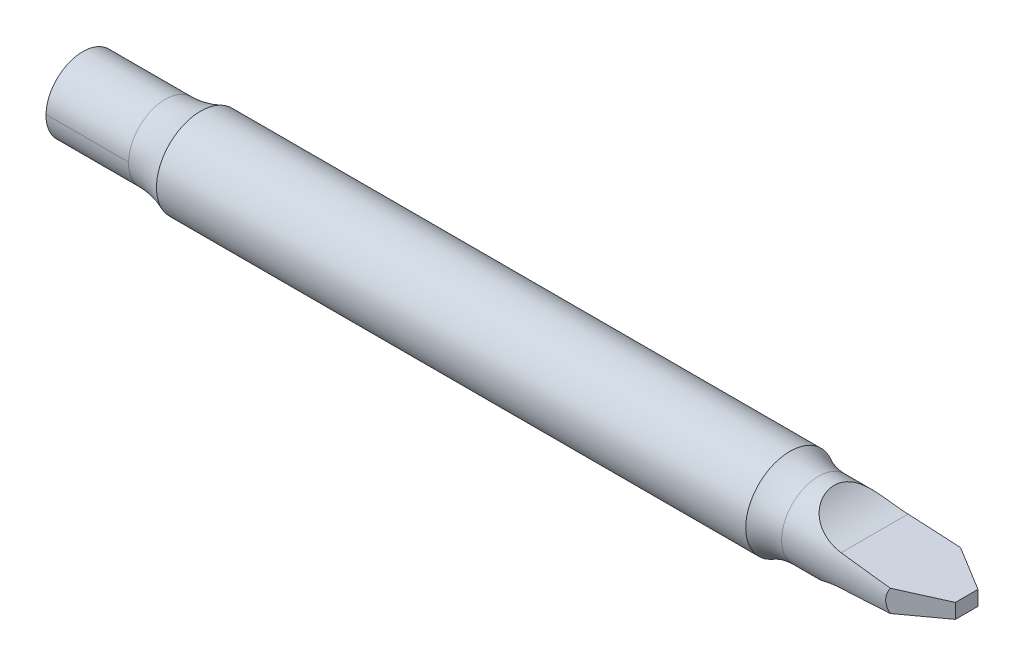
ISO-10303-21;
HEADER;
FILE_DESCRIPTION(('STEP AP214'),'2;1');
FILE_NAME('part.step','',(''),(''),'','','');
FILE_SCHEMA(('AUTOMOTIVE_DESIGN { 1 0 10303 214 1 1 1 1 }'));
ENDSEC;
DATA;
#1=APPLICATION_CONTEXT('core data for automotive mechanical design processes');
#2=APPLICATION_PROTOCOL_DEFINITION('international standard','automotive_design',2000,#1);
#3=PRODUCT_CONTEXT('',#1,'mechanical');
#4=PRODUCT('Part','Part','',(#3));
#5=PRODUCT_RELATED_PRODUCT_CATEGORY('part','',(#4));
#6=PRODUCT_DEFINITION_FORMATION('','',#4);
#7=PRODUCT_DEFINITION_CONTEXT('part definition',#1,'design');
#8=PRODUCT_DEFINITION('design','',#6,#7);
#9=PRODUCT_DEFINITION_SHAPE('','',#8);
#10=(LENGTH_UNIT() NAMED_UNIT(*) SI_UNIT(.MILLI.,.METRE.));
#11=(NAMED_UNIT(*) PLANE_ANGLE_UNIT() SI_UNIT($,.RADIAN.));
#12=(NAMED_UNIT(*) SI_UNIT($,.STERADIAN.) SOLID_ANGLE_UNIT());
#13=UNCERTAINTY_MEASURE_WITH_UNIT(LENGTH_MEASURE(1.E-05),#10,'distance_accuracy_value','');
#14=(GEOMETRIC_REPRESENTATION_CONTEXT(3) GLOBAL_UNCERTAINTY_ASSIGNED_CONTEXT((#13)) GLOBAL_UNIT_ASSIGNED_CONTEXT((#10,
#11,#12)) REPRESENTATION_CONTEXT('',''));
#15=CARTESIAN_POINT('',(0.,0.,0.));
#16=DIRECTION('',(0.,0.,1.));
#17=DIRECTION('',(1.,0.,0.));
#18=AXIS2_PLACEMENT_3D('',#15,#16,#17);
#19=CARTESIAN_POINT('',(50.8,0.,0.));
#20=DIRECTION('',(-1.,0.,0.));
#21=DIRECTION('',(0.,0.,1.));
#22=AXIS2_PLACEMENT_3D('',#19,#20,#21);
#23=CYLINDRICAL_SURFACE('',#22,15.875);
#24=CARTESIAN_POINT('',(35.5732349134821,0.,0.));
#25=DIRECTION('',(1.,0.,0.));
#26=DIRECTION('',(0.,0.,-1.));
#27=AXIS2_PLACEMENT_3D('',#24,#25,#26);
#28=CIRCLE('',#27,15.875);
#29=CARTESIAN_POINT('',(35.5732349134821,-0.333708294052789,-15.8714921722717));
#30=VERTEX_POINT('',#29);
#31=CARTESIAN_POINT('',(35.5732349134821,0.333708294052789,15.8714921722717));
#32=VERTEX_POINT('',#31);
#33=EDGE_CURVE('E307',#30,#32,#28,.F.);
#34=ORIENTED_EDGE('',*,*,#33,.T.);
#35=DIRECTION('',(-1.,0.,0.));
#36=VECTOR('',#35,1.);
#37=CARTESIAN_POINT('',(50.8,0.333708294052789,15.8714921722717));
#38=LINE('',#37,#36);
#39=CARTESIAN_POINT('',(0.,0.333708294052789,15.8714921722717));
#40=VERTEX_POINT('',#39);
#41=EDGE_CURVE('E11',#32,#40,#38,.T.);
#42=ORIENTED_EDGE('',*,*,#41,.T.);
#43=CARTESIAN_POINT('',(0.,0.,0.));
#44=DIRECTION('',(1.,0.,0.));
#45=DIRECTION('',(0.,0.,-1.));
#46=AXIS2_PLACEMENT_3D('',#43,#44,#45);
#47=CIRCLE('',#46,15.875);
#48=CARTESIAN_POINT('',(0.,-0.333708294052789,-15.8714921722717));
#49=VERTEX_POINT('',#48);
#50=EDGE_CURVE('E297',#40,#49,#47,.T.);
#51=ORIENTED_EDGE('',*,*,#50,.T.);
#52=DIRECTION('',(1.,0.,0.));
#53=VECTOR('',#52,1.);
#54=CARTESIAN_POINT('',(50.8,-0.333708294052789,-15.8714921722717));
#55=LINE('',#54,#53);
#56=EDGE_CURVE('E49',#49,#30,#55,.T.);
#57=ORIENTED_EDGE('',*,*,#56,.T.);
#58=EDGE_LOOP('',(#34,#42,#51,#57));
#59=FACE_BOUND('',#58,.T.);
#60=ADVANCED_FACE('F40',(#59),#23,.T.);
#61=CARTESIAN_POINT('',(381.,0.,0.));
#62=DIRECTION('',(-1.,0.,0.));
#63=DIRECTION('',(0.,0.,1.));
#64=AXIS2_PLACEMENT_3D('',#61,#62,#63);
#65=CYLINDRICAL_SURFACE('',#64,15.875);
#66=CARTESIAN_POINT('',(317.096722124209,0.,0.));
#67=DIRECTION('',(-1.,0.,0.));
#68=DIRECTION('',(0.,0.,1.));
#69=AXIS2_PLACEMENT_3D('',#66,#67,#68);
#70=CIRCLE('',#69,15.875);
#71=CARTESIAN_POINT('',(317.096722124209,0.,15.875));
#72=VERTEX_POINT('',#71);
#73=EDGE_CURVE('E303',#72,#72,#70,.F.);
#74=ORIENTED_EDGE('',*,*,#73,.T.);
#75=EDGE_LOOP('',(#74));
#76=FACE_BOUND('',#75,.T.);
#77=CARTESIAN_POINT('',(417.29041606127,0.,0.));
#78=DIRECTION('',(0.0871557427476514,-0.996194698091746,0.));
#79=DIRECTION('',(-0.996194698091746,-0.0871557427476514,0.));
#80=AXIS2_PLACEMENT_3D('',#77,#78,#79);
#81=ELLIPSE('',#80,182.145197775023,15.875);
#82=CARTESIAN_POINT('',(363.200103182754,-4.73228918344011,15.1532525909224));
#83=VERTEX_POINT('',#82);
#84=CARTESIAN_POINT('',(341.301045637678,-6.64820846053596,14.415857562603));
#85=VERTEX_POINT('',#84);
#86=EDGE_CURVE('E285',#83,#85,#81,.T.);
#87=ORIENTED_EDGE('',*,*,#86,.F.);
#88=CARTESIAN_POINT('',(389.446306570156,0.,0.));
#89=DIRECTION('',(0.500000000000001,0.,0.866025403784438));
#90=DIRECTION('',(-0.866025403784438,0.,0.500000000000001));
#91=AXIS2_PLACEMENT_3D('',#88,#89,#90);
#92=ELLIPSE('',#91,31.75,15.875);
#93=CARTESIAN_POINT('',(363.200103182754,4.7322891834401,15.1532525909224));
#94=VERTEX_POINT('',#93);
#95=EDGE_CURVE('E108',#94,#83,#92,.T.);
#96=ORIENTED_EDGE('',*,*,#95,.F.);
#97=CARTESIAN_POINT('',(417.29041606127,0.,0.));
#98=DIRECTION('',(-0.0871557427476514,-0.996194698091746,0.));
#99=DIRECTION('',(-0.996194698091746,0.0871557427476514,0.));
#100=AXIS2_PLACEMENT_3D('',#97,#98,#99);
#101=ELLIPSE('',#100,182.145197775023,15.875);
#102=CARTESIAN_POINT('',(341.301045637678,6.64820846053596,14.415857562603));
#103=VERTEX_POINT('',#102);
#104=EDGE_CURVE('E291',#94,#103,#101,.T.);
#105=ORIENTED_EDGE('',*,*,#104,.T.);
#106=CARTESIAN_POINT('',(341.301045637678,6.64820846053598,-14.415857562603));
#107=CARTESIAN_POINT('',(340.96585426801,6.67752555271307,-14.4023125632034));
#108=CARTESIAN_POINT('',(340.631365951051,6.71350888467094,-14.3856332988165));
#109=CARTESIAN_POINT('',(339.964447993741,6.79866342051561,-14.3455988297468));
#110=CARTESIAN_POINT('',(339.632018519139,6.84783567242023,-14.3222430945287));
#111=CARTESIAN_POINT('',(338.96942041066,6.95930350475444,-14.2684093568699));
#112=CARTESIAN_POINT('',(338.639255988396,7.0216189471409,-14.2379205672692));
#113=CARTESIAN_POINT('',(337.982423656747,7.15910804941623,-14.1692877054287));
#114=CARTESIAN_POINT('',(337.655755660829,7.23428139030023,-14.1311438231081));
#115=CARTESIAN_POINT('',(337.004322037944,7.39779160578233,-14.0462396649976));
#116=CARTESIAN_POINT('',(336.679586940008,7.48621917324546,-13.9994194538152));
#117=CARTESIAN_POINT('',(336.035226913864,7.67546032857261,-13.8965654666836));
#118=CARTESIAN_POINT('',(335.715601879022,7.77627365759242,-13.8405318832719));
#119=CARTESIAN_POINT('',(335.082536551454,7.98974263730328,-13.7184091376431));
#120=CARTESIAN_POINT('',(334.76909193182,8.10238962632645,-13.6523273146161));
#121=CARTESIAN_POINT('',(334.149107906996,8.33897467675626,-13.5091166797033));
#122=CARTESIAN_POINT('',(333.842567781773,8.46291155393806,-13.431989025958));
#123=CARTESIAN_POINT('',(333.122933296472,8.77021446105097,-13.2341931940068));
#124=CARTESIAN_POINT('',(332.713333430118,8.958343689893,-13.1080837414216));
#125=CARTESIAN_POINT('',(331.911765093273,9.35224061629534,-12.8300156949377));
#126=CARTESIAN_POINT('',(331.519795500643,9.55800718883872,-12.6780587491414));
#127=CARTESIAN_POINT('',(330.757847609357,9.98317432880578,-12.3460241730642));
#128=CARTESIAN_POINT('',(330.38779048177,10.202519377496,-12.166057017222));
#129=CARTESIAN_POINT('',(329.671126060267,10.6515223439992,-11.7749422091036));
#130=CARTESIAN_POINT('',(329.324514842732,10.8811785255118,-11.5637997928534));
#131=CARTESIAN_POINT('',(328.713490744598,11.3070416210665,-11.146293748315));
#132=CARTESIAN_POINT('',(328.44501913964,11.5024274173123,-10.9450240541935));
#133=CARTESIAN_POINT('',(327.928105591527,11.8936395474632,-10.5185858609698));
#134=CARTESIAN_POINT('',(327.679661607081,12.0894658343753,-10.2934198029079));
#135=CARTESIAN_POINT('',(327.204203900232,12.4780146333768,-9.81880044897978));
#136=CARTESIAN_POINT('',(326.977197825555,12.6707360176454,-9.56933854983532));
#137=CARTESIAN_POINT('',(326.54595234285,13.0491603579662,-9.04649961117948));
#138=CARTESIAN_POINT('',(326.341713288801,13.2348632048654,-8.77312219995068));
#139=CARTESIAN_POINT('',(325.956019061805,13.5961907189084,-8.20206697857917));
#140=CARTESIAN_POINT('',(325.774676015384,13.7717636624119,-7.90428052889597));
#141=CARTESIAN_POINT('',(325.436480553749,14.1080334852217,-7.28714504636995));
#142=CARTESIAN_POINT('',(325.279628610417,14.2687300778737,-6.967795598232));
#143=CARTESIAN_POINT('',(324.990662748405,14.5716764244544,-6.3097588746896));
#144=CARTESIAN_POINT('',(324.858547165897,14.7139274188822,-5.97107290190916));
#145=CARTESIAN_POINT('',(324.618996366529,14.9768603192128,-5.27702131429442));
#146=CARTESIAN_POINT('',(324.511559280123,15.0975438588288,-4.9216569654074));
#147=CARTESIAN_POINT('',(324.329614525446,15.305055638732,-4.22960368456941));
#148=CARTESIAN_POINT('',(324.253024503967,15.3939434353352,-3.89407604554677));
#149=CARTESIAN_POINT('',(324.119858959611,15.5501284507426,-3.21415264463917));
#150=CARTESIAN_POINT('',(324.063282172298,15.6174270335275,-2.86975744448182));
#151=CARTESIAN_POINT('',(323.96990199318,15.729278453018,-2.17470041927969));
#152=CARTESIAN_POINT('',(323.933096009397,15.7738342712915,-1.82403942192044));
#153=CARTESIAN_POINT('',(323.879056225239,15.8394675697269,-1.1190281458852));
#154=CARTESIAN_POINT('',(323.861822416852,15.8605450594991,-0.764677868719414));
#155=CARTESIAN_POINT('',(323.847019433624,15.8786426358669,-0.0639015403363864));
#156=CARTESIAN_POINT('',(323.848965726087,15.8762554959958,0.282499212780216));
#157=CARTESIAN_POINT('',(323.871374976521,15.8488798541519,0.973799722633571));
#158=CARTESIAN_POINT('',(323.891837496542,15.8238918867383,1.31869951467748));
#159=CARTESIAN_POINT('',(323.951383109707,15.7517129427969,2.00450370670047));
#160=CARTESIAN_POINT('',(323.990464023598,15.7045245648,2.34540856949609));
#161=CARTESIAN_POINT('',(324.087431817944,15.5886994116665,3.02084088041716));
#162=CARTESIAN_POINT('',(324.145318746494,15.5200625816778,3.35536831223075));
#163=CARTESIAN_POINT('',(324.280048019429,15.3625522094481,4.01528999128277));
#164=CARTESIAN_POINT('',(324.356867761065,15.2737028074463,4.340694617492));
#165=CARTESIAN_POINT('',(324.529721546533,15.0771990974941,4.98053135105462));
#166=CARTESIAN_POINT('',(324.625755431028,14.9695449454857,5.29496354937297));
#167=CARTESIAN_POINT('',(324.837189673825,14.7372731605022,5.91072509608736));
#168=CARTESIAN_POINT('',(324.952587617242,14.6126576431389,6.21205607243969));
#169=CARTESIAN_POINT('',(325.202806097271,14.3486026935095,6.79978083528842));
#170=CARTESIAN_POINT('',(325.337626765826,14.2091631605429,7.08617452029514));
#171=CARTESIAN_POINT('',(325.628239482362,13.9162013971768,7.64564076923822));
#172=CARTESIAN_POINT('',(325.784255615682,13.7625352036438,7.91852143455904));
#173=CARTESIAN_POINT('',(326.115699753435,13.4452340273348,8.44606818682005));
#174=CARTESIAN_POINT('',(326.291127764,13.2815990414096,8.70073426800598));
#175=CARTESIAN_POINT('',(326.660831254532,12.9471912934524,9.19096932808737));
#176=CARTESIAN_POINT('',(326.855107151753,12.7764183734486,9.42653788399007));
#177=CARTESIAN_POINT('',(327.261711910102,12.4305827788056,9.87811422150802));
#178=CARTESIAN_POINT('',(327.474041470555,12.2555199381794,10.0941212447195));
#179=CARTESIAN_POINT('',(327.929842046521,11.8926610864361,10.5196642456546));
#180=CARTESIAN_POINT('',(328.174435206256,11.7047643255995,10.7279115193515));
#181=CARTESIAN_POINT('',(328.681549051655,11.3303517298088,11.1226245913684));
#182=CARTESIAN_POINT('',(328.944070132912,11.1438359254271,11.3090899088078));
#183=CARTESIAN_POINT('',(329.485660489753,10.7749019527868,11.6611392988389));
#184=CARTESIAN_POINT('',(329.764736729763,10.592485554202,11.8267144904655));
#185=CARTESIAN_POINT('',(330.337811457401,10.2342512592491,12.1380415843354));
#186=CARTESIAN_POINT('',(330.631812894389,10.0584346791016,12.2837895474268));
#187=CARTESIAN_POINT('',(331.362432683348,9.64181325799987,12.6154404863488));
#188=CARTESIAN_POINT('',(331.806054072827,9.40554172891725,12.7916911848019));
#189=CARTESIAN_POINT('',(332.716331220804,8.95566041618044,13.110601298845));
#190=CARTESIAN_POINT('',(333.182995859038,8.7420594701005,13.2532476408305));
#191=CARTESIAN_POINT('',(334.136262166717,8.34072878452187,13.5094287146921));
#192=CARTESIAN_POINT('',(334.622904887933,8.15305617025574,13.6228996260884));
#193=CARTESIAN_POINT('',(335.611423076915,7.80676474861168,13.8242608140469));
#194=CARTESIAN_POINT('',(336.113295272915,7.64813975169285,13.9121565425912));
#195=CARTESIAN_POINT('',(337.002066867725,7.39750988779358,14.046610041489));
#196=CARTESIAN_POINT('',(337.38636393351,7.29876204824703,14.0980092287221));
#197=CARTESIAN_POINT('',(338.160402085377,7.11915123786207,14.1895547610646));
#198=CARTESIAN_POINT('',(338.550142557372,7.03828626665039,14.2297023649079));
#199=CARTESIAN_POINT('',(339.331725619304,6.89524104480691,14.2995688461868));
#200=CARTESIAN_POINT('',(339.723544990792,6.83296084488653,14.3293436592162));
#201=CARTESIAN_POINT('',(340.510265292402,6.72675391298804,14.3794813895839));
#202=CARTESIAN_POINT('',(340.90516623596,6.6828272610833,14.3998442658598));
#203=CARTESIAN_POINT('',(341.301045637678,6.64820846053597,14.415857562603));
#204=B_SPLINE_CURVE_WITH_KNOTS('',3,(#106,#107,#108,#109,#110,#111,#112,#113,#114,#115,#116,
#117,#118,#119,#120,#121,#122,#123,#124,#125,#126,#127,#128,#129,#130,#131,#132,#133,#134,#135,
#136,#137,#138,#139,#140,#141,#142,#143,#144,#145,#146,#147,#148,#149,#150,#151,#152,#153,#154,
#155,#156,#157,#158,#159,#160,#161,#162,#163,#164,#165,#166,#167,#168,#169,#170,#171,#172,#173,
#174,#175,#176,#177,#178,#179,#180,#181,#182,#183,#184,#185,#186,#187,#188,#189,#190,#191,#192,
#193,#194,#195,#196,#197,#198,#199,#200,#201,#202,#203),.UNSPECIFIED.,.F.,.F.,(4,2,2,2,2,2,2,2,
2,2,2,2,2,2,2,2,2,2,2,2,2,2,2,2,2,2,2,2,2,2,2,2,2,2,2,2,2,2,2,2,2,2,2,2,2,2,2,2,4),(0.,
1.01015937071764,2.02039903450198,3.03217645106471,4.04392876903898,5.06294999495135,
6.08194992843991,7.10020913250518,8.11836165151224,9.52115054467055,10.9238500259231,
12.321151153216,13.7182178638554,14.8819013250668,16.0454660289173,17.2094442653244,
18.3734405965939,19.5429327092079,20.7124473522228,21.8818833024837,23.0512306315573,
24.1162817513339,25.181265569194,26.2461097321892,27.3109534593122,28.3489671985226,
29.3869563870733,30.4248241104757,31.4626944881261,32.4993317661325,33.5359604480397,
34.5724599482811,35.608966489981,36.6574360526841,37.7059059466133,38.7543990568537,
39.8029327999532,40.9182584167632,42.0336086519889,43.1494314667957,44.2654756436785,
45.8610273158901,47.4571987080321,49.0568325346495,50.6561251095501,51.855847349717,
53.0554353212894,54.2484505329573,55.4414709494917),.UNSPECIFIED.);
#205=CARTESIAN_POINT('',(341.301045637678,6.64820846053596,-14.415857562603));
#206=VERTEX_POINT('',#205);
#207=EDGE_CURVE('E127',#206,#103,#204,.T.);
#208=ORIENTED_EDGE('',*,*,#207,.F.);
#209=CARTESIAN_POINT('',(363.200103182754,4.7322891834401,-15.1532525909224));
#210=VERTEX_POINT('',#209);
#211=EDGE_CURVE('E293',#206,#210,#101,.T.);
#212=ORIENTED_EDGE('',*,*,#211,.T.);
#213=CARTESIAN_POINT('',(389.446306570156,0.,0.));
#214=DIRECTION('',(-0.500000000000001,0.,0.866025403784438));
#215=DIRECTION('',(-0.866025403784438,0.,-0.500000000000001));
#216=AXIS2_PLACEMENT_3D('',#213,#214,#215);
#217=ELLIPSE('',#216,31.75,15.875);
#218=CARTESIAN_POINT('',(363.200103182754,-4.73228918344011,-15.1532525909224));
#219=VERTEX_POINT('',#218);
#220=EDGE_CURVE('E274',#210,#219,#217,.T.);
#221=ORIENTED_EDGE('',*,*,#220,.T.);
#222=CARTESIAN_POINT('',(341.301045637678,-6.64820846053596,-14.415857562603));
#223=VERTEX_POINT('',#222);
#224=EDGE_CURVE('E287',#223,#219,#81,.T.);
#225=ORIENTED_EDGE('',*,*,#224,.F.);
#226=CARTESIAN_POINT('',(341.301045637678,-6.64820846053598,-14.415857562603));
#227=CARTESIAN_POINT('',(340.96585426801,-6.67752555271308,-14.4023125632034));
#228=CARTESIAN_POINT('',(340.631365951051,-6.71350888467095,-14.3856332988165));
#229=CARTESIAN_POINT('',(339.964447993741,-6.79866342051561,-14.3455988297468));
#230=CARTESIAN_POINT('',(339.632018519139,-6.84783567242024,-14.3222430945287));
#231=CARTESIAN_POINT('',(338.96942041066,-6.95930350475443,-14.2684093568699));
#232=CARTESIAN_POINT('',(338.639255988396,-7.0216189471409,-14.2379205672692));
#233=CARTESIAN_POINT('',(337.982423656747,-7.15910804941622,-14.1692877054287));
#234=CARTESIAN_POINT('',(337.655755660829,-7.23428139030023,-14.1311438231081));
#235=CARTESIAN_POINT('',(337.004322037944,-7.39779160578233,-14.0462396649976));
#236=CARTESIAN_POINT('',(336.679586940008,-7.48621917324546,-13.9994194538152));
#237=CARTESIAN_POINT('',(336.035226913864,-7.67546032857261,-13.8965654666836));
#238=CARTESIAN_POINT('',(335.715601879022,-7.77627365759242,-13.8405318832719));
#239=CARTESIAN_POINT('',(335.082536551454,-7.98974263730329,-13.7184091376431));
#240=CARTESIAN_POINT('',(334.76909193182,-8.10238962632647,-13.6523273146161));
#241=CARTESIAN_POINT('',(334.149107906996,-8.33897467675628,-13.5091166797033));
#242=CARTESIAN_POINT('',(333.842567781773,-8.46291155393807,-13.431989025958));
#243=CARTESIAN_POINT('',(333.122933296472,-8.77021446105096,-13.2341931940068));
#244=CARTESIAN_POINT('',(332.713333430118,-8.958343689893,-13.1080837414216));
#245=CARTESIAN_POINT('',(331.911765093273,-9.35224061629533,-12.8300156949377));
#246=CARTESIAN_POINT('',(331.519795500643,-9.5580071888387,-12.6780587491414));
#247=CARTESIAN_POINT('',(330.757847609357,-9.98317432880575,-12.3460241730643));
#248=CARTESIAN_POINT('',(330.38779048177,-10.202519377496,-12.1660570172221));
#249=CARTESIAN_POINT('',(329.671126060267,-10.6515223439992,-11.7749422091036));
#250=CARTESIAN_POINT('',(329.324514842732,-10.8811785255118,-11.5637997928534));
#251=CARTESIAN_POINT('',(328.713490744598,-11.3070416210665,-11.146293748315));
#252=CARTESIAN_POINT('',(328.44501913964,-11.5024274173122,-10.9450240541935));
#253=CARTESIAN_POINT('',(327.928105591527,-11.8936395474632,-10.5185858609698));
#254=CARTESIAN_POINT('',(327.679661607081,-12.0894658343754,-10.2934198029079));
#255=CARTESIAN_POINT('',(327.204203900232,-12.4780146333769,-9.81880044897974));
#256=CARTESIAN_POINT('',(326.977197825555,-12.6707360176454,-9.5693385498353));
#257=CARTESIAN_POINT('',(326.54595234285,-13.0491603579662,-9.04649961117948));
#258=CARTESIAN_POINT('',(326.341713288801,-13.2348632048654,-8.77312219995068));
#259=CARTESIAN_POINT('',(325.956019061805,-13.5961907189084,-8.20206697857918));
#260=CARTESIAN_POINT('',(325.774676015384,-13.7717636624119,-7.90428052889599));
#261=CARTESIAN_POINT('',(325.436480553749,-14.1080334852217,-7.28714504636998));
#262=CARTESIAN_POINT('',(325.279628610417,-14.2687300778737,-6.96779559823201));
#263=CARTESIAN_POINT('',(324.990662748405,-14.5716764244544,-6.30975887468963));
#264=CARTESIAN_POINT('',(324.858547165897,-14.7139274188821,-5.9710729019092));
#265=CARTESIAN_POINT('',(324.618996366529,-14.9768603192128,-5.27702131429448));
#266=CARTESIAN_POINT('',(324.511559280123,-15.0975438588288,-4.92165696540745));
#267=CARTESIAN_POINT('',(324.329614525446,-15.305055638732,-4.22960368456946));
#268=CARTESIAN_POINT('',(324.253024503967,-15.3939434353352,-3.89407604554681));
#269=CARTESIAN_POINT('',(324.119858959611,-15.5501284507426,-3.2141526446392));
#270=CARTESIAN_POINT('',(324.063282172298,-15.6174270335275,-2.86975744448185));
#271=CARTESIAN_POINT('',(323.96990199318,-15.729278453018,-2.1747004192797));
#272=CARTESIAN_POINT('',(323.933096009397,-15.7738342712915,-1.82403942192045));
#273=CARTESIAN_POINT('',(323.879056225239,-15.8394675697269,-1.11902814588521));
#274=CARTESIAN_POINT('',(323.861822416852,-15.8605450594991,-0.764677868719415));
#275=CARTESIAN_POINT('',(323.847019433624,-15.8786426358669,-0.0639015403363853));
#276=CARTESIAN_POINT('',(323.848965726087,-15.8762554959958,0.282499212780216));
#277=CARTESIAN_POINT('',(323.871374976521,-15.8488798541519,0.973799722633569));
#278=CARTESIAN_POINT('',(323.891837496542,-15.8238918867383,1.31869951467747));
#279=CARTESIAN_POINT('',(323.951383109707,-15.7517129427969,2.00450370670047));
#280=CARTESIAN_POINT('',(323.990464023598,-15.7045245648,2.34540856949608));
#281=CARTESIAN_POINT('',(324.087431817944,-15.5886994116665,3.02084088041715));
#282=CARTESIAN_POINT('',(324.145318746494,-15.5200625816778,3.35536831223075));
#283=CARTESIAN_POINT('',(324.280048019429,-15.3625522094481,4.01528999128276));
#284=CARTESIAN_POINT('',(324.356867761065,-15.2737028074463,4.34069461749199));
#285=CARTESIAN_POINT('',(324.529721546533,-15.0771990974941,4.98053135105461));
#286=CARTESIAN_POINT('',(324.625755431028,-14.9695449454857,5.29496354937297));
#287=CARTESIAN_POINT('',(324.837189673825,-14.7372731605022,5.91072509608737));
#288=CARTESIAN_POINT('',(324.952587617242,-14.6126576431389,6.21205607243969));
#289=CARTESIAN_POINT('',(325.202806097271,-14.3486026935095,6.79978083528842));
#290=CARTESIAN_POINT('',(325.337626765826,-14.2091631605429,7.08617452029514));
#291=CARTESIAN_POINT('',(325.628239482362,-13.9162013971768,7.64564076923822));
#292=CARTESIAN_POINT('',(325.784255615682,-13.7625352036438,7.91852143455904));
#293=CARTESIAN_POINT('',(326.115699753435,-13.4452340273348,8.44606818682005));
#294=CARTESIAN_POINT('',(326.291127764,-13.2815990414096,8.70073426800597));
#295=CARTESIAN_POINT('',(326.660831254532,-12.9471912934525,9.19096932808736));
#296=CARTESIAN_POINT('',(326.855107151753,-12.7764183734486,9.42653788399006));
#297=CARTESIAN_POINT('',(327.261711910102,-12.4305827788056,9.87811422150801));
#298=CARTESIAN_POINT('',(327.474041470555,-12.2555199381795,10.0941212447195));
#299=CARTESIAN_POINT('',(327.929842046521,-11.8926610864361,10.5196642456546));
#300=CARTESIAN_POINT('',(328.174435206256,-11.7047643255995,10.7279115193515));
#301=CARTESIAN_POINT('',(328.681549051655,-11.3303517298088,11.1226245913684));
#302=CARTESIAN_POINT('',(328.944070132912,-11.143835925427,11.3090899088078));
#303=CARTESIAN_POINT('',(329.485660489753,-10.7749019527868,11.6611392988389));
#304=CARTESIAN_POINT('',(329.764736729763,-10.592485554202,11.8267144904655));
#305=CARTESIAN_POINT('',(330.337811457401,-10.2342512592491,12.1380415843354));
#306=CARTESIAN_POINT('',(330.631812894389,-10.0584346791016,12.2837895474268));
#307=CARTESIAN_POINT('',(331.362432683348,-9.64181325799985,12.6154404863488));
#308=CARTESIAN_POINT('',(331.806054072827,-9.40554172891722,12.791691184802));
#309=CARTESIAN_POINT('',(332.716331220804,-8.95566041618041,13.110601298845));
#310=CARTESIAN_POINT('',(333.182995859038,-8.74205947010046,13.2532476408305));
#311=CARTESIAN_POINT('',(334.136262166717,-8.34072878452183,13.5094287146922));
#312=CARTESIAN_POINT('',(334.622904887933,-8.15305617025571,13.6228996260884));
#313=CARTESIAN_POINT('',(335.611423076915,-7.80676474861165,13.8242608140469));
#314=CARTESIAN_POINT('',(336.113295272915,-7.64813975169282,13.9121565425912));
#315=CARTESIAN_POINT('',(337.002066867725,-7.39750988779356,14.046610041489));
#316=CARTESIAN_POINT('',(337.38636393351,-7.29876204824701,14.0980092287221));
#317=CARTESIAN_POINT('',(338.160402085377,-7.11915123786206,14.1895547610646));
#318=CARTESIAN_POINT('',(338.550142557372,-7.03828626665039,14.2297023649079));
#319=CARTESIAN_POINT('',(339.331725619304,-6.8952410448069,14.2995688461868));
#320=CARTESIAN_POINT('',(339.723544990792,-6.83296084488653,14.3293436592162));
#321=CARTESIAN_POINT('',(340.510265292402,-6.72675391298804,14.3794813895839));
#322=CARTESIAN_POINT('',(340.90516623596,-6.6828272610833,14.3998442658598));
#323=CARTESIAN_POINT('',(341.301045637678,-6.64820846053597,14.415857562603));
#324=B_SPLINE_CURVE_WITH_KNOTS('',3,(#226,#227,#228,#229,#230,#231,#232,#233,#234,#235,#236,
#237,#238,#239,#240,#241,#242,#243,#244,#245,#246,#247,#248,#249,#250,#251,#252,#253,#254,#255,
#256,#257,#258,#259,#260,#261,#262,#263,#264,#265,#266,#267,#268,#269,#270,#271,#272,#273,#274,
#275,#276,#277,#278,#279,#280,#281,#282,#283,#284,#285,#286,#287,#288,#289,#290,#291,#292,#293,
#294,#295,#296,#297,#298,#299,#300,#301,#302,#303,#304,#305,#306,#307,#308,#309,#310,#311,#312,
#313,#314,#315,#316,#317,#318,#319,#320,#321,#322,#323),.UNSPECIFIED.,.F.,.F.,(4,2,2,2,2,2,2,2,
2,2,2,2,2,2,2,2,2,2,2,2,2,2,2,2,2,2,2,2,2,2,2,2,2,2,2,2,2,2,2,2,2,2,2,2,2,2,2,2,4),(0.,
1.01015937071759,2.02039903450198,3.03217645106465,4.04392876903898,5.06294999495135,
6.08194992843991,7.10020913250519,8.11836165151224,9.52115054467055,10.923850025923,
12.321151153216,13.7182178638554,14.8819013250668,16.0454660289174,17.2094442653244,
18.3734405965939,19.5429327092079,20.7124473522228,21.8818833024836,23.0512306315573,
24.1162817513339,25.181265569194,26.2461097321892,27.3109534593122,28.3489671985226,
29.3869563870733,30.4248241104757,31.4626944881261,32.4993317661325,33.5359604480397,
34.5724599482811,35.608966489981,36.6574360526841,37.7059059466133,38.7543990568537,
39.8029327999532,40.9182584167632,42.0336086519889,43.1494314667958,44.2654756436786,
45.8610273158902,47.4571987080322,49.0568325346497,50.6561251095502,51.8558473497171,
53.0554353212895,54.2484505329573,55.4414709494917),.UNSPECIFIED.);
#325=EDGE_CURVE('E126',#223,#85,#324,.T.);
#326=ORIENTED_EDGE('',*,*,#325,.T.);
#327=EDGE_LOOP('',(#87,#96,#105,#208,#212,#221,#225,#326));
#328=FACE_BOUND('',#327,.T.);
#329=ADVANCED_FACE('F146',(#76,#328),#65,.T.);
#330=CARTESIAN_POINT('',(381.,0.,0.));
#331=DIRECTION('',(1.,0.,0.));
#332=DIRECTION('',(0.,0.,-1.));
#333=AXIS2_PLACEMENT_3D('',#330,#331,#332);
#334=PLANE('',#333);
#335=DIRECTION('',(0.,0.,-1.));
#336=VECTOR('',#335,1.);
#337=CARTESIAN_POINT('',(381.,3.175,0.));
#338=LINE('',#337,#336);
#339=CARTESIAN_POINT('',(381.,3.17499999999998,4.87647737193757));
#340=VERTEX_POINT('',#339);
#341=CARTESIAN_POINT('',(381.,3.17499999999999,-4.87647737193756));
#342=VERTEX_POINT('',#341);
#343=EDGE_CURVE('E120',#340,#342,#338,.T.);
#344=ORIENTED_EDGE('',*,*,#343,.F.);
#345=DIRECTION('',(0.,1.,0.));
#346=VECTOR('',#345,1.);
#347=CARTESIAN_POINT('',(381.,-38.1,4.87647737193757));
#348=LINE('',#347,#346);
#349=CARTESIAN_POINT('',(381.,-3.175,4.87647737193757));
#350=VERTEX_POINT('',#349);
#351=EDGE_CURVE('E105',#350,#340,#348,.T.);
#352=ORIENTED_EDGE('',*,*,#351,.F.);
#353=DIRECTION('',(0.,0.,-1.));
#354=VECTOR('',#353,1.);
#355=CARTESIAN_POINT('',(381.,-3.175,0.));
#356=LINE('',#355,#354);
#357=CARTESIAN_POINT('',(381.,-3.175,-4.87647737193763));
#358=VERTEX_POINT('',#357);
#359=EDGE_CURVE('E118',#350,#358,#356,.T.);
#360=ORIENTED_EDGE('',*,*,#359,.T.);
#361=DIRECTION('',(0.,1.,0.));
#362=VECTOR('',#361,1.);
#363=CARTESIAN_POINT('',(381.,-38.1,-4.87647737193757));
#364=LINE('',#363,#362);
#365=EDGE_CURVE('E271',#358,#342,#364,.T.);
#366=ORIENTED_EDGE('',*,*,#365,.T.);
#367=EDGE_LOOP('',(#344,#352,#360,#366));
#368=FACE_BOUND('',#367,.T.);
#369=ADVANCED_FACE('F116',(#368),#334,.T.);
#370=CARTESIAN_POINT('',(341.301045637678,6.64820846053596,-38.1));
#371=DIRECTION('',(-0.0871557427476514,-0.996194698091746,0.));
#372=DIRECTION('',(0.996194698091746,-0.0871557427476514,0.));
#373=AXIS2_PLACEMENT_3D('',#370,#371,#372);
#374=PLANE('',#373);
#375=DIRECTION('',(-0.863550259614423,0.0755508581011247,0.498570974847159));
#376=VECTOR('',#375,1.);
#377=CARTESIAN_POINT('',(369.672274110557,4.16604759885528,11.4165429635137));
#378=LINE('',#377,#376);
#379=EDGE_CURVE('E275',#340,#94,#378,.T.);
#380=ORIENTED_EDGE('',*,*,#379,.F.);
#381=ORIENTED_EDGE('',*,*,#343,.T.);
#382=DIRECTION('',(-0.863550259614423,0.0755508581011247,-0.498570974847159));
#383=VECTOR('',#382,1.);
#384=CARTESIAN_POINT('',(336.865042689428,7.03630842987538,-30.3578068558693));
#385=LINE('',#384,#383);
#386=EDGE_CURVE('E273',#342,#210,#385,.T.);
#387=ORIENTED_EDGE('',*,*,#386,.T.);
#388=ORIENTED_EDGE('',*,*,#211,.F.);
#389=DIRECTION('',(0.,0.,1.));
#390=VECTOR('',#389,1.);
#391=CARTESIAN_POINT('',(341.301045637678,6.64820846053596,-38.1));
#392=LINE('',#391,#390);
#393=EDGE_CURVE('E288',#206,#103,#392,.T.);
#394=ORIENTED_EDGE('',*,*,#393,.T.);
#395=ORIENTED_EDGE('',*,*,#104,.F.);
#396=EDGE_LOOP('',(#380,#381,#387,#388,#394,#395));
#397=FACE_BOUND('',#396,.T.);
#398=ADVANCED_FACE('F159',(#397),#374,.F.);
#399=CARTESIAN_POINT('',(341.301045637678,-6.64820846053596,-38.1));
#400=DIRECTION('',(0.0871557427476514,-0.996194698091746,0.));
#401=DIRECTION('',(0.996194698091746,0.0871557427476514,0.));
#402=AXIS2_PLACEMENT_3D('',#399,#400,#401);
#403=PLANE('',#402);
#404=ORIENTED_EDGE('',*,*,#359,.F.);
#405=DIRECTION('',(-0.863550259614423,-0.0755508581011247,0.498570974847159));
#406=VECTOR('',#405,1.);
#407=CARTESIAN_POINT('',(369.672274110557,-4.16604759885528,11.4165429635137));
#408=LINE('',#407,#406);
#409=EDGE_CURVE('E102',#350,#83,#408,.T.);
#410=ORIENTED_EDGE('',*,*,#409,.T.);
#411=ORIENTED_EDGE('',*,*,#86,.T.);
#412=DIRECTION('',(0.,0.,1.));
#413=VECTOR('',#412,1.);
#414=CARTESIAN_POINT('',(341.301045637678,-6.64820846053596,-38.1));
#415=LINE('',#414,#413);
#416=EDGE_CURVE('E282',#223,#85,#415,.T.);
#417=ORIENTED_EDGE('',*,*,#416,.F.);
#418=ORIENTED_EDGE('',*,*,#224,.T.);
#419=DIRECTION('',(-0.863550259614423,-0.0755508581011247,-0.498570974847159));
#420=VECTOR('',#419,1.);
#421=CARTESIAN_POINT('',(336.865042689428,-7.03630842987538,-30.3578068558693));
#422=LINE('',#421,#420);
#423=EDGE_CURVE('E112',#358,#219,#422,.T.);
#424=ORIENTED_EDGE('',*,*,#423,.F.);
#425=EDGE_LOOP('',(#404,#410,#411,#417,#418,#424));
#426=FACE_BOUND('',#425,.T.);
#427=ADVANCED_FACE('F123',(#426),#403,.T.);
#428=ORIENTED_EDGE('',*,*,#41,.F.);
#429=EDGE_CURVE('E306',#32,#30,#28,.F.);
#430=ORIENTED_EDGE('',*,*,#429,.T.);
#431=ORIENTED_EDGE('',*,*,#56,.F.);
#432=EDGE_CURVE('E301',#49,#40,#47,.T.);
#433=ORIENTED_EDGE('',*,*,#432,.T.);
#434=EDGE_LOOP('',(#428,#430,#431,#433));
#435=FACE_BOUND('',#434,.T.);
#436=ADVANCED_FACE('F172',(#435),#23,.T.);
#437=CARTESIAN_POINT('',(0.,0.,0.));
#438=DIRECTION('',(1.,0.,0.));
#439=DIRECTION('',(0.,0.,-1.));
#440=AXIS2_PLACEMENT_3D('',#437,#438,#439);
#441=PLANE('',#440);
#442=ORIENTED_EDGE('',*,*,#432,.F.);
#443=ORIENTED_EDGE('',*,*,#50,.F.);
#444=EDGE_LOOP('',(#442,#443));
#445=FACE_BOUND('',#444,.T.);
#446=ADVANCED_FACE('F177',(#445),#441,.F.);
#447=CARTESIAN_POINT('',(304.8,0.,0.));
#448=DIRECTION('',(-1.,0.,0.));
#449=DIRECTION('',(0.,0.,1.));
#450=AXIS2_PLACEMENT_3D('',#447,#448,#449);
#451=CYLINDRICAL_SURFACE('',#450,19.05);
#452=CARTESIAN_POINT('',(304.8,0.,0.));
#453=DIRECTION('',(1.,0.,0.));
#454=DIRECTION('',(0.,0.,-1.));
#455=AXIS2_PLACEMENT_3D('',#452,#453,#454);
#456=CIRCLE('',#455,19.05);
#457=CARTESIAN_POINT('',(304.8,0.,-19.05));
#458=VERTEX_POINT('',#457);
#459=EDGE_CURVE('E294',#458,#458,#456,.T.);
#460=ORIENTED_EDGE('',*,*,#459,.F.);
#461=EDGE_LOOP('',(#460));
#462=FACE_BOUND('',#461,.T.);
#463=CARTESIAN_POINT('',(50.8,0.,0.));
#464=DIRECTION('',(1.,0.,0.));
#465=DIRECTION('',(0.,0.,-1.));
#466=AXIS2_PLACEMENT_3D('',#463,#464,#465);
#467=CIRCLE('',#466,19.05);
#468=CARTESIAN_POINT('',(50.8,0.,-19.05));
#469=VERTEX_POINT('',#468);
#470=EDGE_CURVE('E298',#469,#469,#467,.T.);
#471=ORIENTED_EDGE('',*,*,#470,.T.);
#472=EDGE_LOOP('',(#471));
#473=FACE_BOUND('',#472,.T.);
#474=ADVANCED_FACE('F182',(#462,#473),#451,.T.);
#475=CARTESIAN_POINT('',(317.096722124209,0.,0.));
#476=DIRECTION('',(-1.,0.,0.));
#477=DIRECTION('',(0.,0.,1.));
#478=AXIS2_PLACEMENT_3D('',#475,#476,#477);
#479=TOROIDAL_SURFACE('',#478,41.275,25.4);
#480=ORIENTED_EDGE('',*,*,#459,.T.);
#481=EDGE_LOOP('',(#480));
#482=FACE_BOUND('',#481,.T.);
#483=ORIENTED_EDGE('',*,*,#73,.F.);
#484=EDGE_LOOP('',(#483));
#485=FACE_BOUND('',#484,.T.);
#486=ADVANCED_FACE('F237',(#482,#485),#479,.F.);
#487=CARTESIAN_POINT('',(35.5732349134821,0.,0.));
#488=DIRECTION('',(1.,0.,0.));
#489=DIRECTION('',(0.,0.,-1.));
#490=AXIS2_PLACEMENT_3D('',#487,#488,#489);
#491=TOROIDAL_SURFACE('',#490,53.975,38.1);
#492=ORIENTED_EDGE('',*,*,#33,.F.);
#493=ORIENTED_EDGE('',*,*,#429,.F.);
#494=EDGE_LOOP('',(#492,#493));
#495=FACE_BOUND('',#494,.T.);
#496=ORIENTED_EDGE('',*,*,#470,.F.);
#497=EDGE_LOOP('',(#496));
#498=FACE_BOUND('',#497,.T.);
#499=ADVANCED_FACE('F42',(#495,#498),#491,.F.);
#500=CARTESIAN_POINT('',(343.514801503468,31.9515537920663,-38.1));
#501=DIRECTION('',(0.,0.,1.));
#502=DIRECTION('',(1.,0.,0.));
#503=AXIS2_PLACEMENT_3D('',#500,#501,#502);
#504=CYLINDRICAL_SURFACE('',#503,25.4);
#505=ORIENTED_EDGE('',*,*,#393,.F.);
#506=ORIENTED_EDGE('',*,*,#207,.T.);
#507=EDGE_LOOP('',(#505,#506));
#508=FACE_BOUND('',#507,.T.);
#509=ADVANCED_FACE('F156',(#508),#504,.F.);
#510=CARTESIAN_POINT('',(343.514801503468,-31.9515537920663,-38.1));
#511=DIRECTION('',(0.,0.,1.));
#512=DIRECTION('',(1.,0.,0.));
#513=AXIS2_PLACEMENT_3D('',#510,#511,#512);
#514=CYLINDRICAL_SURFACE('',#513,25.4);
#515=ORIENTED_EDGE('',*,*,#416,.T.);
#516=ORIENTED_EDGE('',*,*,#325,.F.);
#517=EDGE_LOOP('',(#515,#516));
#518=FACE_BOUND('',#517,.T.);
#519=ADVANCED_FACE('F150',(#518),#514,.F.);
#520=CARTESIAN_POINT('',(361.95,-38.1,-15.875));
#521=DIRECTION('',(-0.500000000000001,0.,0.866025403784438));
#522=DIRECTION('',(0.866025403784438,0.,0.500000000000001));
#523=AXIS2_PLACEMENT_3D('',#520,#521,#522);
#524=PLANE('',#523);
#525=ORIENTED_EDGE('',*,*,#365,.F.);
#526=ORIENTED_EDGE('',*,*,#423,.T.);
#527=ORIENTED_EDGE('',*,*,#220,.F.);
#528=ORIENTED_EDGE('',*,*,#386,.F.);
#529=EDGE_LOOP('',(#525,#526,#527,#528));
#530=FACE_BOUND('',#529,.T.);
#531=ADVANCED_FACE('F155',(#530),#524,.F.);
#532=CARTESIAN_POINT('',(361.95,-38.1,15.875));
#533=DIRECTION('',(0.500000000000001,0.,0.866025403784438));
#534=DIRECTION('',(0.866025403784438,0.,-0.500000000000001));
#535=AXIS2_PLACEMENT_3D('',#532,#533,#534);
#536=PLANE('',#535);
#537=ORIENTED_EDGE('',*,*,#379,.T.);
#538=ORIENTED_EDGE('',*,*,#95,.T.);
#539=ORIENTED_EDGE('',*,*,#409,.F.);
#540=ORIENTED_EDGE('',*,*,#351,.T.);
#541=EDGE_LOOP('',(#537,#538,#539,#540));
#542=FACE_BOUND('',#541,.T.);
#543=ADVANCED_FACE('F104',(#542),#536,.T.);
#544=CLOSED_SHELL('',(#60,#329,#369,#398,#427,#436,#446,#474,#486,#499,#509,#519,#531,#543));
#545=MANIFOLD_SOLID_BREP('B2',#544);
#546=ADVANCED_BREP_SHAPE_REPRESENTATION('',(#18,#545),#14);
#547=SHAPE_DEFINITION_REPRESENTATION(#9,#546);
ENDSEC;
END-ISO-10303-21;
